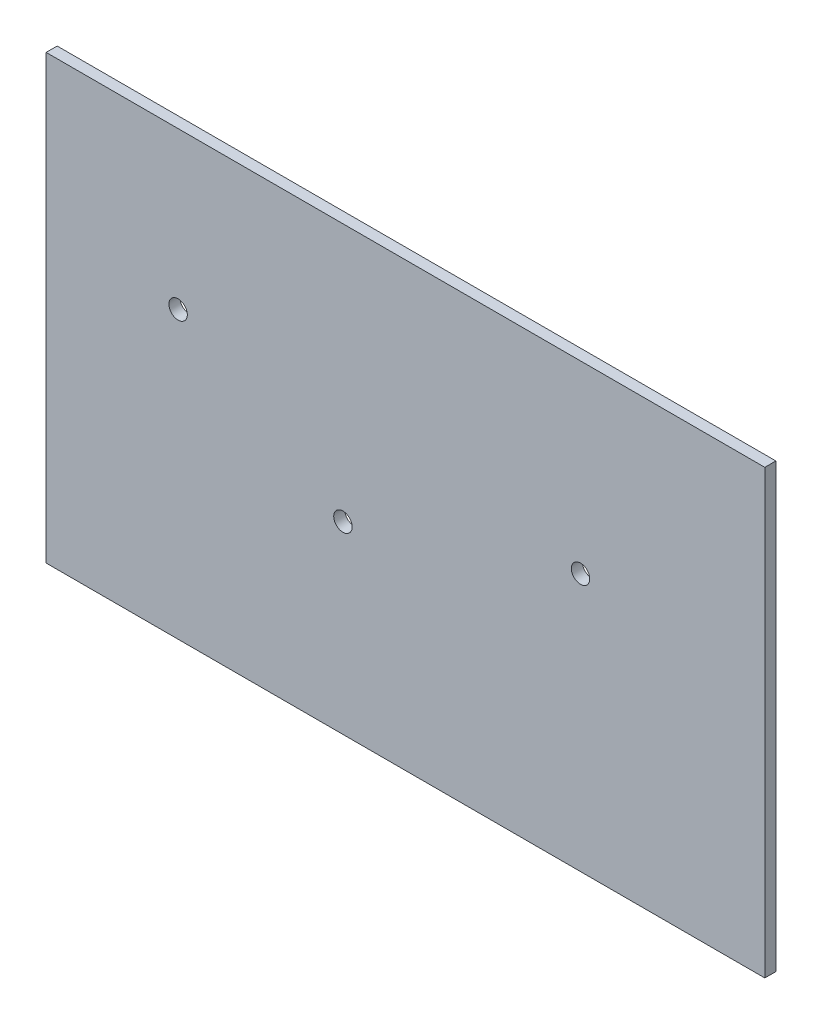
from build123d import *

# Parameters (mm, degrees)
ESQUISSE1_W             = 195
ESQUISSE1_H             = 120
EXTRUSION1_DEPTH        = 3
ESQUISSE2_R             = 2.5
ENL_V_MAT_EXTRU_1_DEPTH = 138.903574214


with BuildPart() as part:
    # Esquisse1 → Extrusion1 (new body)
    with BuildSketch(Plane.XY):
        with Locations((21.725497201, -9.236382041)):
            Rectangle(ESQUISSE1_W, ESQUISSE1_H)
    extrude(amount=EXTRUSION1_DEPTH)

    # Esquisse2 → Enl_v. mat.-Extru.1 (cut, through all)
    with BuildSketch(Plane.XY.offset(3)):
        with Locations((69.225497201, 0.763617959)):
            Circle(ESQUISSE2_R)
        with Locations((4.75651241, -19.236382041)):
            Circle(ESQUISSE2_R)
        with Locations((-39.96484714, 8.263617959)):
            Circle(ESQUISSE2_R)
    extrude(amount=-ENL_V_MAT_EXTRU_1_DEPTH, mode=Mode.SUBTRACT)


solid = part.part
